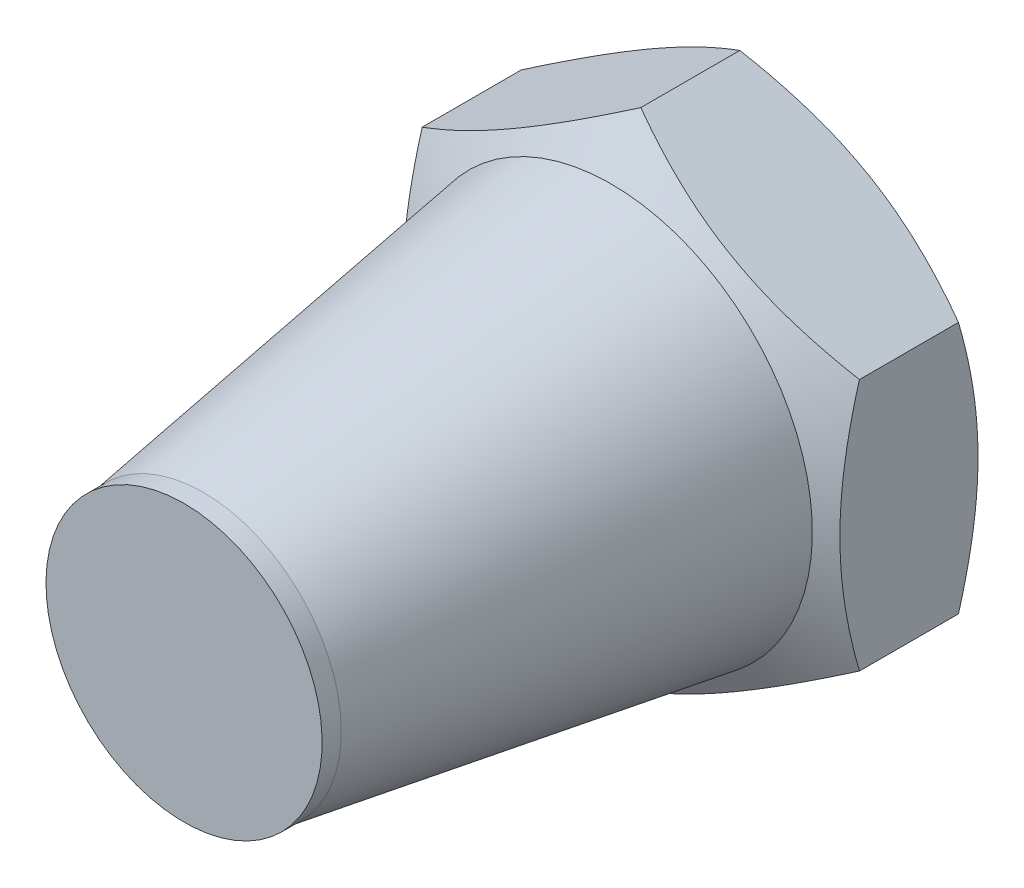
ISO-10303-21;
HEADER;
FILE_DESCRIPTION(('STEP AP214'),'2;1');
FILE_NAME('part.step','',(''),(''),'','','');
FILE_SCHEMA(('AUTOMOTIVE_DESIGN { 1 0 10303 214 1 1 1 1 }'));
ENDSEC;
DATA;
#1=APPLICATION_CONTEXT('core data for automotive mechanical design processes');
#2=APPLICATION_PROTOCOL_DEFINITION('international standard','automotive_design',2000,#1);
#3=PRODUCT_CONTEXT('',#1,'mechanical');
#4=PRODUCT('Part','Part','',(#3));
#5=PRODUCT_RELATED_PRODUCT_CATEGORY('part','',(#4));
#6=PRODUCT_DEFINITION_FORMATION('','',#4);
#7=PRODUCT_DEFINITION_CONTEXT('part definition',#1,'design');
#8=PRODUCT_DEFINITION('design','',#6,#7);
#9=PRODUCT_DEFINITION_SHAPE('','',#8);
#10=(LENGTH_UNIT() NAMED_UNIT(*) SI_UNIT(.MILLI.,.METRE.));
#11=(NAMED_UNIT(*) PLANE_ANGLE_UNIT() SI_UNIT($,.RADIAN.));
#12=(NAMED_UNIT(*) SI_UNIT($,.STERADIAN.) SOLID_ANGLE_UNIT());
#13=UNCERTAINTY_MEASURE_WITH_UNIT(LENGTH_MEASURE(1.E-05),#10,'distance_accuracy_value','');
#14=(GEOMETRIC_REPRESENTATION_CONTEXT(3) GLOBAL_UNCERTAINTY_ASSIGNED_CONTEXT((#13)) GLOBAL_UNIT_ASSIGNED_CONTEXT((#10,
#11,#12)) REPRESENTATION_CONTEXT('',''));
#15=CARTESIAN_POINT('',(0.,0.,0.));
#16=DIRECTION('',(0.,0.,1.));
#17=DIRECTION('',(1.,0.,0.));
#18=AXIS2_PLACEMENT_3D('',#15,#16,#17);
#19=CARTESIAN_POINT('',(0.,0.,3.));
#20=DIRECTION('',(0.,0.,-1.));
#21=DIRECTION('',(-0.500000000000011,0.866025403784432,0.));
#22=AXIS2_PLACEMENT_3D('',#19,#20,#21);
#23=CONICAL_SURFACE('',#22,14.696152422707,1.04719755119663);
#24=CARTESIAN_POINT('',(0.,0.,6.4387862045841));
#25=DIRECTION('',(0.,0.,-1.));
#26=DIRECTION('',(-0.500000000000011,0.866025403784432,0.));
#27=AXIS2_PLACEMENT_3D('',#24,#25,#26);
#28=CIRCLE('',#27,8.74);
#29=CARTESIAN_POINT('',(-4.3700000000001,7.56906202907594,6.4387862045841));
#30=VERTEX_POINT('',#29);
#31=EDGE_CURVE('E280',#30,#30,#28,.T.);
#32=ORIENTED_EDGE('',*,*,#31,.T.);
#33=EDGE_LOOP('',(#32));
#34=FACE_BOUND('',#33,.T.);
#35=CARTESIAN_POINT('',(-17.554595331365,0.83450477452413,1.33823181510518));
#36=CARTESIAN_POINT('',(-17.3747338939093,0.938347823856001,1.43910889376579));
#37=CARTESIAN_POINT('',(-17.1946626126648,1.04231202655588,1.53948688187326));
#38=CARTESIAN_POINT('',(-16.8340565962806,1.25050800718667,1.73913173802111));
#39=CARTESIAN_POINT('',(-16.653521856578,1.35473978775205,1.83839859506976));
#40=CARTESIAN_POINT('',(-16.1111093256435,1.66790180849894,2.13438889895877));
#41=CARTESIAN_POINT('',(-15.7484757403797,1.87726840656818,2.32927254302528));
#42=CARTESIAN_POINT('',(-15.0188452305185,2.29852077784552,2.71400300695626));
#43=CARTESIAN_POINT('',(-14.651835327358,2.5104140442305,2.90381708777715));
#44=CARTESIAN_POINT('',(-13.9149128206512,2.9358764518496,3.27574988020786));
#45=CARTESIAN_POINT('',(-13.5450003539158,3.14944551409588,3.45786895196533));
#46=CARTESIAN_POINT('',(-12.7895973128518,3.58557766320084,3.81814124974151));
#47=CARTESIAN_POINT('',(-12.4039911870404,3.80820746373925,3.99597319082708));
#48=CARTESIAN_POINT('',(-11.6282855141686,4.25606134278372,4.33830520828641));
#49=CARTESIAN_POINT('',(-11.238185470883,4.48128570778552,4.50280379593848));
#50=CARTESIAN_POINT('',(-10.4535819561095,4.93427675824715,4.81418869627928));
#51=CARTESIAN_POINT('',(-10.0590890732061,5.1620373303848,4.96111020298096));
#52=CARTESIAN_POINT('',(-9.26445874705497,5.62081736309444,5.23266326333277));
#53=CARTESIAN_POINT('',(-8.86432310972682,5.85183578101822,5.35730178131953));
#54=CARTESIAN_POINT('',(-8.06032905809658,6.31602196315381,5.57767285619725));
#55=CARTESIAN_POINT('',(-7.65650395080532,6.54917049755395,5.67356307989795));
#56=CARTESIAN_POINT('',(-7.04705287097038,6.90103724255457,5.79170894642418));
#57=CARTESIAN_POINT('',(-6.84326907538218,7.01869187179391,5.82681089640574));
#58=CARTESIAN_POINT('',(-6.4346731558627,7.25459483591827,5.8877644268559));
#59=CARTESIAN_POINT('',(-6.22986113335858,7.37284311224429,5.91361690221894));
#60=CARTESIAN_POINT('',(-5.82217958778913,7.60821816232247,5.9552293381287));
#61=CARTESIAN_POINT('',(-5.61931991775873,7.72533924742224,5.97111749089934));
#62=CARTESIAN_POINT('',(-5.21320037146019,7.95981247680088,5.99297114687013));
#63=CARTESIAN_POINT('',(-5.00994050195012,8.07716461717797,5.99893681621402));
#64=CARTESIAN_POINT('',(-4.60338385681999,8.31189020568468,6.00080302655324));
#65=CARTESIAN_POINT('',(-4.40008708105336,8.42926365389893,5.99670352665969));
#66=CARTESIAN_POINT('',(-3.99382512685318,8.66381910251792,5.97854027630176));
#67=CARTESIAN_POINT('',(-3.79085996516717,8.78100109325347,5.96447603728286));
#68=CARTESIAN_POINT('',(-3.3044770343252,9.06181440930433,5.91913176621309));
#69=CARTESIAN_POINT('',(-3.02137657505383,9.22526253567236,5.88321395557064));
#70=CARTESIAN_POINT('',(-2.45726005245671,9.55095536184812,5.79393895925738));
#71=CARTESIAN_POINT('',(-2.17624427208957,9.71319989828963,5.74057944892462));
#72=CARTESIAN_POINT('',(-1.33665683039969,10.1979359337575,5.55716611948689));
#73=CARTESIAN_POINT('',(-0.781851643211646,10.5182528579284,5.40380988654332));
#74=CARTESIAN_POINT('',(0.0478465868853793,10.997279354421,5.13760699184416));
#75=CARTESIAN_POINT('',(0.327036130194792,11.1584695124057,5.04158640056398));
#76=CARTESIAN_POINT('',(0.882703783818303,11.4792843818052,4.8395066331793));
#77=CARTESIAN_POINT('',(1.15918187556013,11.6389090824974,4.7334473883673));
#78=CARTESIAN_POINT('',(1.70951316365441,11.9566429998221,4.51299759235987));
#79=CARTESIAN_POINT('',(1.98336717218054,12.1147526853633,4.39860971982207));
#80=CARTESIAN_POINT('',(2.52880163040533,12.4296594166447,4.16285521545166));
#81=CARTESIAN_POINT('',(2.80038211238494,12.5864564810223,4.0414886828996));
#82=CARTESIAN_POINT('',(3.46345047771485,12.9692791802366,3.73693329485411));
#83=CARTESIAN_POINT('',(3.85382887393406,13.1946642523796,3.5505288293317));
#84=CARTESIAN_POINT('',(4.63109013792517,13.6434162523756,3.16821435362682));
#85=CARTESIAN_POINT('',(5.01797275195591,13.866783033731,2.9723036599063));
#86=CARTESIAN_POINT('',(5.78893210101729,14.3118966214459,2.57297026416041));
#87=CARTESIAN_POINT('',(6.17300807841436,14.5336429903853,2.36954561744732));
#88=CARTESIAN_POINT('',(6.93874708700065,14.9757426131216,1.95677322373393));
#89=CARTESIAN_POINT('',(7.32041017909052,15.1960959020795,1.74742562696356));
#90=CARTESIAN_POINT('',(8.08220788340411,15.635920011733,1.32370484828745));
#91=CARTESIAN_POINT('',(8.46234006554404,15.8553894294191,1.1093258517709));
#92=CARTESIAN_POINT('',(9.22094119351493,16.2933679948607,0.676679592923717));
#93=CARTESIAN_POINT('',(9.59941013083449,16.511877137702,0.4584123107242));
#94=CARTESIAN_POINT('',(10.354894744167,16.9480563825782,0.0187149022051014));
#95=CARTESIAN_POINT('',(10.7319106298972,17.1657266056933,-0.202714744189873));
#96=CARTESIAN_POINT('',(11.4847633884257,17.6003863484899,-0.648231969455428));
#97=CARTESIAN_POINT('',(11.8606002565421,17.8173758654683,-0.872319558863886));
#98=CARTESIAN_POINT('',(12.9195383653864,18.4287540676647,-1.50766534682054));
#99=CARTESIAN_POINT('',(13.6014831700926,18.8224750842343,-1.9214932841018));
#100=CARTESIAN_POINT('',(14.9628991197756,19.6084889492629,-2.7546043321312));
#101=CARTESIAN_POINT('',(15.6423701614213,20.0007817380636,-3.17388766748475));
#102=CARTESIAN_POINT('',(16.997542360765,20.783190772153,-4.01545975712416));
#103=CARTESIAN_POINT('',(17.6732487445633,21.1733100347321,-4.43773729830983));
#104=CARTESIAN_POINT('',(18.6856528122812,21.7578217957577,-5.07354826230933));
#105=CARTESIAN_POINT('',(19.0229182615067,21.9525420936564,-5.28587802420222));
#106=CARTESIAN_POINT('',(19.6971091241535,22.3417863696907,-5.7112548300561));
#107=CARTESIAN_POINT('',(20.0340345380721,22.5363103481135,-5.92430187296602));
#108=CARTESIAN_POINT('',(20.3708096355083,22.7307475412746,-6.13766535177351));
#109=B_SPLINE_CURVE_WITH_KNOTS('',3,(#35,#36,#37,#38,#39,#40,#41,#42,#43,#44,#45,#46,#47,#48,
#49,#50,#51,#52,#53,#54,#55,#56,#57,#58,#59,#60,#61,#62,#63,#64,#65,#66,#67,#68,#69,#70,#71,#72,
#73,#74,#75,#76,#77,#78,#79,#80,#81,#82,#83,#84,#85,#86,#87,#88,#89,#90,#91,#92,#93,#94,#95,#96,
#97,#98,#99,#100,#101,#102,#103,#104,#105,#106,#107,#108),.UNSPECIFIED.,.F.,.F.,(4,2,2,2,2,2,2,
2,2,2,2,2,2,2,2,2,2,2,2,2,2,2,2,2,2,2,2,2,2,2,2,2,2,2,2,2,4),(0.,0.692665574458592,
1.38533799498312,2.77088518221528,4.16388664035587,5.55682282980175,6.99503223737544,
8.4334020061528,9.86884178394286,11.3038321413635,12.7308020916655,13.4443879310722,
14.1579047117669,14.8620428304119,15.5661691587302,16.2702983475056,16.9744620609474,
17.9604967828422,18.9466629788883,20.9200570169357,21.9291006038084,22.9381510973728,
23.946878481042,24.9555915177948,26.4188141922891,27.8821422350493,29.3458516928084,
30.8095240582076,32.2749804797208,33.7404443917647,35.205688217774,36.6709378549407,
39.3395877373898,42.0083478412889,44.6698810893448,46.0005687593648,47.3312544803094),.UNSPECIFIED.);
#110=CARTESIAN_POINT('',(-1.81278603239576E-13,10.9696551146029,5.15149422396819));
#111=VERTEX_POINT('',#110);
#112=CARTESIAN_POINT('',(-9.5,5.48482755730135,5.15149422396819));
#113=VERTEX_POINT('',#112);
#114=EDGE_CURVE('E102',#111,#113,#109,.F.);
#115=ORIENTED_EDGE('',*,*,#114,.T.);
#116=CARTESIAN_POINT('',(-9.5,5.48505849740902,5.15142755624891));
#117=CARTESIAN_POINT('',(-9.5,5.24392149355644,5.22102656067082));
#118=CARTESIAN_POINT('',(-9.5,5.00188540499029,5.28746669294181));
#119=CARTESIAN_POINT('',(-9.5,4.51587227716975,5.41315271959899));
#120=CARTESIAN_POINT('',(-9.5,4.27189462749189,5.4723962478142));
#121=CARTESIAN_POINT('',(-9.5,3.53603045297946,5.63818542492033));
#122=CARTESIAN_POINT('',(-9.5,3.04123900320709,5.73248555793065));
#123=CARTESIAN_POINT('',(-9.5,2.30080624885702,5.84306129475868));
#124=CARTESIAN_POINT('',(-9.5,2.05737704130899,5.87456017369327));
#125=CARTESIAN_POINT('',(-9.5,1.56939156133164,5.92738179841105));
#126=CARTESIAN_POINT('',(-9.5,1.32483526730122,5.94870434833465));
#127=CARTESIAN_POINT('',(-9.5,0.83531474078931,5.98062697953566));
#128=CARTESIAN_POINT('',(-9.5,0.590351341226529,5.99123980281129));
#129=CARTESIAN_POINT('',(-9.5,0.100198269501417,6.00151746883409));
#130=CARTESIAN_POINT('',(-9.5,-0.14499139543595,6.00118264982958));
#131=CARTESIAN_POINT('',(-9.5,-0.603379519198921,5.99032663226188));
#132=CARTESIAN_POINT('',(-9.5,-0.816610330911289,5.98112973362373));
#133=CARTESIAN_POINT('',(-9.5,-1.24257325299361,5.95463460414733));
#134=CARTESIAN_POINT('',(-9.5,-1.45530532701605,5.9373358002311));
#135=CARTESIAN_POINT('',(-9.5,-2.09267726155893,5.87369551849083));
#136=CARTESIAN_POINT('',(-9.5,-2.51618892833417,5.81561809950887));
#137=CARTESIAN_POINT('',(-9.5,-3.36770470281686,5.67042398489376));
#138=CARTESIAN_POINT('',(-9.5,-3.79560013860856,5.58269183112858));
#139=CARTESIAN_POINT('',(-9.5,-4.64501006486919,5.38357626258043));
#140=CARTESIAN_POINT('',(-9.5,-5.06653543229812,5.27223961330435));
#141=CARTESIAN_POINT('',(-9.5,-5.4850584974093,5.15142755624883));
#142=B_SPLINE_CURVE_WITH_KNOTS('',3,(#116,#117,#118,#119,#120,#121,#122,#123,#124,#125,#126,
#127,#128,#129,#130,#131,#132,#133,#134,#135,#136,#137,#138,#139,#140,#141),.UNSPECIFIED.,.F.,
.F.,(4,2,2,2,2,2,2,2,2,2,2,2,4),(0.,0.752880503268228,1.50600787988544,3.01546870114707,
3.75167336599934,4.48789219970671,5.22323407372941,5.9585532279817,6.59868084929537,
7.23885375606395,8.52010929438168,9.82978009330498,11.1368800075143),.UNSPECIFIED.);
#143=CARTESIAN_POINT('',(-9.5,-5.48482755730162,5.15149422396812));
#144=VERTEX_POINT('',#143);
#145=EDGE_CURVE('E93',#113,#144,#142,.T.);
#146=ORIENTED_EDGE('',*,*,#145,.T.);
#147=CARTESIAN_POINT('',(-9.5002,-5.48471208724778,5.15142755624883));
#148=CARTESIAN_POINT('',(-9.2913692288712,-5.60528058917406,5.22102656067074));
#149=CARTESIAN_POINT('',(-9.08175982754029,-5.72629863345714,5.28746669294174));
#150=CARTESIAN_POINT('',(-8.66086011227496,-5.9693051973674,5.41315271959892));
#151=CARTESIAN_POINT('',(-8.4495692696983,-6.09129402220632,5.47239624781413));
#152=CARTESIAN_POINT('',(-7.81229220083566,-6.45922610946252,5.63818542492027));
#153=CARTESIAN_POINT('',(-7.38379023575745,-6.7066218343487,5.7324855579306));
#154=CARTESIAN_POINT('',(-6.74255666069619,-7.07683821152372,5.84306129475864));
#155=CARTESIAN_POINT('',(-6.53174078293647,-7.19855281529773,5.87456017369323));
#156=CARTESIAN_POINT('',(-6.10913296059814,-7.4425455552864,5.92738179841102));
#157=CARTESIAN_POINT('',(-5.89734099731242,-7.5648237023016,5.94870434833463));
#158=CARTESIAN_POINT('',(-5.47340378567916,-7.80958396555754,5.98062697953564));
#159=CARTESIAN_POINT('',(-5.26125925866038,-7.93206566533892,5.99123980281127));
#160=CARTESIAN_POINT('',(-4.83677424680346,-8.17714220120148,6.00151746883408));
#161=CARTESIAN_POINT('',(-4.62443376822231,-8.29973703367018,6.00118264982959));
#162=CARTESIAN_POINT('',(-4.22745800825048,-8.52893109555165,5.99032663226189));
#163=CARTESIAN_POINT('',(-4.04279470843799,-8.63554650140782,5.98112973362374));
#164=CARTESIAN_POINT('',(-3.67389999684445,-8.84852796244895,5.95463460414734));
#165=CARTESIAN_POINT('',(-3.48966861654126,-8.95489399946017,5.93733580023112));
#166=CARTESIAN_POINT('',(-2.93768832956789,-9.2735799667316,5.87369551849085));
#167=CARTESIAN_POINT('',(-2.57091646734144,-9.4853358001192,5.81561809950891));
#168=CARTESIAN_POINT('',(-1.83348217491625,-9.91109368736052,5.67042398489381));
#169=CARTESIAN_POINT('',(-1.46291385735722,-10.1250414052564,5.58269183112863));
#170=CARTESIAN_POINT('',(-0.72730328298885,-10.5497463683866,5.38357626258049));
#171=CARTESIAN_POINT('',(-0.362251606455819,-10.7605090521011,5.27223961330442));
#172=CARTESIAN_POINT('',(0.000200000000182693,-10.9697705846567,5.15142755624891));
#173=B_SPLINE_CURVE_WITH_KNOTS('',3,(#147,#148,#149,#150,#151,#152,#153,#154,#155,#156,#157,
#158,#159,#160,#161,#162,#163,#164,#165,#166,#167,#168,#169,#170,#171,#172),.UNSPECIFIED.,.F.,
.F.,(4,2,2,2,2,2,2,2,2,2,2,2,4),(0.,0.752880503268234,1.50600787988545,3.01546870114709,
3.75167336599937,4.48789219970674,5.22323407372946,5.95855322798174,6.59868084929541,
7.23885375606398,8.5201092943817,9.82978009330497,11.1368800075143),.UNSPECIFIED.);
#174=CARTESIAN_POINT('',(1.81278603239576E-13,-10.9696551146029,5.15149422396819));
#175=VERTEX_POINT('',#174);
#176=EDGE_CURVE('E82',#144,#175,#173,.T.);
#177=ORIENTED_EDGE('',*,*,#176,.T.);
#178=CARTESIAN_POINT('',(-8.0545953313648,-15.6199778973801,1.33823181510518));
#179=CARTESIAN_POINT('',(-7.87473389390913,-15.5161348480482,1.43910889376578));
#180=CARTESIAN_POINT('',(-7.69466261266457,-15.4121706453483,1.53948688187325));
#181=CARTESIAN_POINT('',(-7.33405659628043,-15.2039746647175,1.7391317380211));
#182=CARTESIAN_POINT('',(-7.15352185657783,-15.0997428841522,1.83839859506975));
#183=CARTESIAN_POINT('',(-6.61110932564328,-14.7865808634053,2.13438889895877));
#184=CARTESIAN_POINT('',(-6.24847574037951,-14.577214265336,2.32927254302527));
#185=CARTESIAN_POINT('',(-5.51884523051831,-14.1559618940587,2.71400300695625));
#186=CARTESIAN_POINT('',(-5.15183532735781,-13.9440686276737,2.90381708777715));
#187=CARTESIAN_POINT('',(-4.41491282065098,-13.5186062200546,3.27574988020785));
#188=CARTESIAN_POINT('',(-4.04500035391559,-13.3050371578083,3.45786895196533));
#189=CARTESIAN_POINT('',(-3.28959731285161,-12.8689050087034,3.81814124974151));
#190=CARTESIAN_POINT('',(-2.90399118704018,-12.646275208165,3.99597319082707));
#191=CARTESIAN_POINT('',(-2.12828551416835,-12.1984213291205,4.33830520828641));
#192=CARTESIAN_POINT('',(-1.73818547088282,-11.9731969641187,4.50280379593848));
#193=CARTESIAN_POINT('',(-0.953581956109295,-11.5202059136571,4.81418869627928));
#194=CARTESIAN_POINT('',(-0.559089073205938,-11.2924453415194,4.96111020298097));
#195=CARTESIAN_POINT('',(0.23554125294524,-10.8336653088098,5.23266326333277));
#196=CARTESIAN_POINT('',(0.635676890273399,-10.602646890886,5.35730178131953));
#197=CARTESIAN_POINT('',(1.43967094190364,-10.1384607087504,5.57767285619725));
#198=CARTESIAN_POINT('',(1.84349604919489,-9.90531217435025,5.67356307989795));
#199=CARTESIAN_POINT('',(2.45294712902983,-9.55344542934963,5.79170894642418));
#200=CARTESIAN_POINT('',(2.65673092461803,-9.4357908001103,5.82681089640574));
#201=CARTESIAN_POINT('',(3.06532684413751,-9.19988783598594,5.8877644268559));
#202=CARTESIAN_POINT('',(3.27013886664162,-9.08163955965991,5.91361690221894));
#203=CARTESIAN_POINT('',(3.67782041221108,-8.84626450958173,5.9552293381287));
#204=CARTESIAN_POINT('',(3.88068008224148,-8.72914342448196,5.97111749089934));
#205=CARTESIAN_POINT('',(4.28679962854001,-8.49467019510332,5.99297114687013));
#206=CARTESIAN_POINT('',(4.49005949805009,-8.37731805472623,5.99893681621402));
#207=CARTESIAN_POINT('',(4.89661614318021,-8.14259246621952,6.00080302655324));
#208=CARTESIAN_POINT('',(5.09991291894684,-8.02521901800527,5.99670352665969));
#209=CARTESIAN_POINT('',(5.50617487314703,-7.79066356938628,5.97854027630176));
#210=CARTESIAN_POINT('',(5.70914003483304,-7.67348157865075,5.96447603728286));
#211=CARTESIAN_POINT('',(6.19552296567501,-7.39266826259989,5.91913176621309));
#212=CARTESIAN_POINT('',(6.47862342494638,-7.22922013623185,5.88321395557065));
#213=CARTESIAN_POINT('',(7.0427399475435,-6.90352731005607,5.79393895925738));
#214=CARTESIAN_POINT('',(7.32375572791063,-6.74128277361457,5.74057944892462));
#215=CARTESIAN_POINT('',(8.16334316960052,-6.25654673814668,5.55716611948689));
#216=CARTESIAN_POINT('',(8.71814835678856,-5.93622981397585,5.40380988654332));
#217=CARTESIAN_POINT('',(9.54784658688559,-5.45720331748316,5.13760699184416));
#218=CARTESIAN_POINT('',(9.827036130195,-5.29601315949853,5.04158640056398));
#219=CARTESIAN_POINT('',(10.3827037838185,-4.97519829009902,4.8395066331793));
#220=CARTESIAN_POINT('',(10.6591818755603,-4.81557358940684,4.7334473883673));
#221=CARTESIAN_POINT('',(11.2095131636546,-4.49783967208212,4.51299759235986));
#222=CARTESIAN_POINT('',(11.4833671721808,-4.3397299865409,4.39860971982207));
#223=CARTESIAN_POINT('',(12.0288016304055,-4.02482325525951,4.16285521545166));
#224=CARTESIAN_POINT('',(12.3003821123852,-3.86802619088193,4.0414886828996));
#225=CARTESIAN_POINT('',(12.9634504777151,-3.48520349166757,3.73693329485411));
#226=CARTESIAN_POINT('',(13.3538288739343,-3.25981841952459,3.5505288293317));
#227=CARTESIAN_POINT('',(14.1310901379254,-2.81106641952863,3.16821435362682));
#228=CARTESIAN_POINT('',(14.5179727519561,-2.58769963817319,2.97230365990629));
#229=CARTESIAN_POINT('',(15.2889321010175,-2.14258605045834,2.57297026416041));
#230=CARTESIAN_POINT('',(15.6730080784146,-1.92083968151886,2.36954561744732));
#231=CARTESIAN_POINT('',(16.4387470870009,-1.47874005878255,1.95677322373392));
#232=CARTESIAN_POINT('',(16.8204101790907,-1.25838676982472,1.74742562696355));
#233=CARTESIAN_POINT('',(17.5822078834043,-0.818562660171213,1.32370484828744));
#234=CARTESIAN_POINT('',(17.9623400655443,-0.599093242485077,1.1093258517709));
#235=CARTESIAN_POINT('',(18.7209411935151,-0.161114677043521,0.676679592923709));
#236=CARTESIAN_POINT('',(19.0994101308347,0.0573944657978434,0.458412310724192));
#237=CARTESIAN_POINT('',(19.8548947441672,0.493573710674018,0.0187149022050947));
#238=CARTESIAN_POINT('',(20.2319106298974,0.711243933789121,-0.202714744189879));
#239=CARTESIAN_POINT('',(20.9847633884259,1.14590367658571,-0.648231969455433));
#240=CARTESIAN_POINT('',(21.3606002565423,1.3628931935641,-0.872319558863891));
#241=CARTESIAN_POINT('',(22.4195383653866,1.97427139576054,-1.50766534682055));
#242=CARTESIAN_POINT('',(23.1014831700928,2.3679924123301,-1.9214932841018));
#243=CARTESIAN_POINT('',(24.4628991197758,3.15400627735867,-2.7546043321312));
#244=CARTESIAN_POINT('',(25.1423701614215,3.54629906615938,-3.17388766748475));
#245=CARTESIAN_POINT('',(26.4975423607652,4.3287081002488,-4.01545975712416));
#246=CARTESIAN_POINT('',(27.1732487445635,4.7188273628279,-4.43773729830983));
#247=CARTESIAN_POINT('',(28.1856528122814,5.30333912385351,-5.07354826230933));
#248=CARTESIAN_POINT('',(28.5229182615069,5.49805942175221,-5.28587802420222));
#249=CARTESIAN_POINT('',(29.1971091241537,5.88730369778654,-5.71125483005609));
#250=CARTESIAN_POINT('',(29.5340345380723,6.08182767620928,-5.92430187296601));
#251=CARTESIAN_POINT('',(29.8708096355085,6.27626486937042,-6.13766535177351));
#252=B_SPLINE_CURVE_WITH_KNOTS('',3,(#178,#179,#180,#181,#182,#183,#184,#185,#186,#187,#188,
#189,#190,#191,#192,#193,#194,#195,#196,#197,#198,#199,#200,#201,#202,#203,#204,#205,#206,#207,
#208,#209,#210,#211,#212,#213,#214,#215,#216,#217,#218,#219,#220,#221,#222,#223,#224,#225,#226,
#227,#228,#229,#230,#231,#232,#233,#234,#235,#236,#237,#238,#239,#240,#241,#242,#243,#244,#245,
#246,#247,#248,#249,#250,#251),.UNSPECIFIED.,.F.,.F.,(4,2,2,2,2,2,2,2,2,2,2,2,2,2,2,2,2,2,2,2,2,
2,2,2,2,2,2,2,2,2,2,2,2,2,2,2,4),(0.,0.692665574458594,1.38533799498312,2.77088518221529,
4.16388664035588,5.55682282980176,6.99503223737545,8.43340200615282,9.86884178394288,
11.3038321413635,12.7308020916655,13.4443879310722,14.1579047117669,14.8620428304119,
15.5661691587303,16.2702983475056,16.9744620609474,17.9604967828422,18.9466629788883,
20.9200570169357,21.9291006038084,22.9381510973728,23.946878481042,24.9555915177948,
26.4188141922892,27.8821422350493,29.3458516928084,30.8095240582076,32.2749804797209,
33.7404443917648,35.205688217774,36.6709378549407,39.3395877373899,42.0083478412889,
44.6698810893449,46.0005687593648,47.3312544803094),.UNSPECIFIED.);
#253=CARTESIAN_POINT('',(9.5,-5.48482755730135,5.15149422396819));
#254=VERTEX_POINT('',#253);
#255=EDGE_CURVE('E229',#175,#254,#252,.T.);
#256=ORIENTED_EDGE('',*,*,#255,.T.);
#257=CARTESIAN_POINT('',(9.5,-5.48505849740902,5.15142755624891));
#258=CARTESIAN_POINT('',(9.5,-5.24392149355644,5.22102656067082));
#259=CARTESIAN_POINT('',(9.5,-5.00188540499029,5.28746669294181));
#260=CARTESIAN_POINT('',(9.5,-4.51587227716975,5.41315271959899));
#261=CARTESIAN_POINT('',(9.5,-4.27189462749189,5.4723962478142));
#262=CARTESIAN_POINT('',(9.5,-3.53603045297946,5.63818542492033));
#263=CARTESIAN_POINT('',(9.5,-3.04123900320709,5.73248555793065));
#264=CARTESIAN_POINT('',(9.5,-2.30080624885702,5.84306129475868));
#265=CARTESIAN_POINT('',(9.5,-2.05737704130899,5.87456017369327));
#266=CARTESIAN_POINT('',(9.5,-1.56939156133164,5.92738179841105));
#267=CARTESIAN_POINT('',(9.5,-1.32483526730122,5.94870434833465));
#268=CARTESIAN_POINT('',(9.5,-0.83531474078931,5.98062697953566));
#269=CARTESIAN_POINT('',(9.5,-0.590351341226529,5.99123980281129));
#270=CARTESIAN_POINT('',(9.5,-0.100198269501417,6.00151746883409));
#271=CARTESIAN_POINT('',(9.5,0.14499139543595,6.00118264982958));
#272=CARTESIAN_POINT('',(9.5,0.603379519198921,5.99032663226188));
#273=CARTESIAN_POINT('',(9.5,0.816610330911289,5.98112973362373));
#274=CARTESIAN_POINT('',(9.5,1.24257325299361,5.95463460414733));
#275=CARTESIAN_POINT('',(9.5,1.45530532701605,5.9373358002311));
#276=CARTESIAN_POINT('',(9.5,2.09267726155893,5.87369551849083));
#277=CARTESIAN_POINT('',(9.5,2.51618892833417,5.81561809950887));
#278=CARTESIAN_POINT('',(9.5,3.36770470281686,5.67042398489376));
#279=CARTESIAN_POINT('',(9.5,3.79560013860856,5.58269183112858));
#280=CARTESIAN_POINT('',(9.5,4.64501006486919,5.38357626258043));
#281=CARTESIAN_POINT('',(9.5,5.06653543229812,5.27223961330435));
#282=CARTESIAN_POINT('',(9.5,5.4850584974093,5.15142755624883));
#283=B_SPLINE_CURVE_WITH_KNOTS('',3,(#257,#258,#259,#260,#261,#262,#263,#264,#265,#266,#267,
#268,#269,#270,#271,#272,#273,#274,#275,#276,#277,#278,#279,#280,#281,#282),.UNSPECIFIED.,.F.,
.F.,(4,2,2,2,2,2,2,2,2,2,2,2,4),(0.,0.752880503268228,1.50600787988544,3.01546870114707,
3.75167336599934,4.48789219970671,5.22323407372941,5.9585532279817,6.59868084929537,
7.23885375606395,8.52010929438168,9.82978009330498,11.1368800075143),.UNSPECIFIED.);
#284=CARTESIAN_POINT('',(9.5,5.48482755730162,5.15149422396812));
#285=VERTEX_POINT('',#284);
#286=EDGE_CURVE('E215',#254,#285,#283,.T.);
#287=ORIENTED_EDGE('',*,*,#286,.T.);
#288=CARTESIAN_POINT('',(9.5002,5.48471208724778,5.15142755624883));
#289=CARTESIAN_POINT('',(9.2913692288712,5.60528058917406,5.22102656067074));
#290=CARTESIAN_POINT('',(9.08175982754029,5.72629863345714,5.28746669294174));
#291=CARTESIAN_POINT('',(8.66086011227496,5.9693051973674,5.41315271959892));
#292=CARTESIAN_POINT('',(8.4495692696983,6.09129402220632,5.47239624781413));
#293=CARTESIAN_POINT('',(7.81229220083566,6.45922610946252,5.63818542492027));
#294=CARTESIAN_POINT('',(7.38379023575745,6.7066218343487,5.7324855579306));
#295=CARTESIAN_POINT('',(6.74255666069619,7.07683821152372,5.84306129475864));
#296=CARTESIAN_POINT('',(6.53174078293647,7.19855281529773,5.87456017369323));
#297=CARTESIAN_POINT('',(6.10913296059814,7.4425455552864,5.92738179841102));
#298=CARTESIAN_POINT('',(5.89734099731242,7.5648237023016,5.94870434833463));
#299=CARTESIAN_POINT('',(5.47340378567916,7.80958396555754,5.98062697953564));
#300=CARTESIAN_POINT('',(5.26125925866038,7.93206566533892,5.99123980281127));
#301=CARTESIAN_POINT('',(4.83677424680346,8.17714220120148,6.00151746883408));
#302=CARTESIAN_POINT('',(4.62443376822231,8.29973703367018,6.00118264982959));
#303=CARTESIAN_POINT('',(4.22745800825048,8.52893109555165,5.99032663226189));
#304=CARTESIAN_POINT('',(4.04279470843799,8.63554650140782,5.98112973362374));
#305=CARTESIAN_POINT('',(3.67389999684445,8.84852796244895,5.95463460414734));
#306=CARTESIAN_POINT('',(3.48966861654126,8.95489399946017,5.93733580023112));
#307=CARTESIAN_POINT('',(2.93768832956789,9.2735799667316,5.87369551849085));
#308=CARTESIAN_POINT('',(2.57091646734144,9.4853358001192,5.81561809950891));
#309=CARTESIAN_POINT('',(1.83348217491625,9.91109368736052,5.67042398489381));
#310=CARTESIAN_POINT('',(1.46291385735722,10.1250414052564,5.58269183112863));
#311=CARTESIAN_POINT('',(0.72730328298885,10.5497463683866,5.38357626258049));
#312=CARTESIAN_POINT('',(0.362251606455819,10.7605090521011,5.27223961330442));
#313=CARTESIAN_POINT('',(-0.000200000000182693,10.9697705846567,5.15142755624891));
#314=B_SPLINE_CURVE_WITH_KNOTS('',3,(#288,#289,#290,#291,#292,#293,#294,#295,#296,#297,#298,
#299,#300,#301,#302,#303,#304,#305,#306,#307,#308,#309,#310,#311,#312,#313),.UNSPECIFIED.,.F.,
.F.,(4,2,2,2,2,2,2,2,2,2,2,2,4),(0.,0.752880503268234,1.50600787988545,3.01546870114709,
3.75167336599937,4.48789219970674,5.22323407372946,5.95855322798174,6.59868084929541,
7.23885375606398,8.5201092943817,9.82978009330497,11.1368800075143),.UNSPECIFIED.);
#315=EDGE_CURVE('E188',#285,#111,#314,.T.);
#316=ORIENTED_EDGE('',*,*,#315,.T.);
#317=EDGE_LOOP('',(#115,#146,#177,#256,#287,#316));
#318=FACE_BOUND('',#317,.T.);
#319=ADVANCED_FACE('F14',(#34,#318),#23,.T.);
#320=CARTESIAN_POINT('',(0.,0.,25.));
#321=DIRECTION('',(0.,0.,1.));
#322=DIRECTION('',(0.500000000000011,-0.866025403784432,0.));
#323=AXIS2_PLACEMENT_3D('',#320,#321,#322);
#324=PLANE('',#323);
#325=CARTESIAN_POINT('',(0.,0.,25.));
#326=DIRECTION('',(0.,0.,-1.));
#327=DIRECTION('',(-0.500000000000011,0.866025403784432,0.));
#328=AXIS2_PLACEMENT_3D('',#325,#326,#327);
#329=CIRCLE('',#328,6.);
#330=CARTESIAN_POINT('',(-3.00000000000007,5.19615242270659,25.));
#331=VERTEX_POINT('',#330);
#332=EDGE_CURVE('E9',#331,#331,#329,.T.);
#333=ORIENTED_EDGE('',*,*,#332,.F.);
#334=EDGE_LOOP('',(#333));
#335=FACE_BOUND('',#334,.T.);
#336=ADVANCED_FACE('F16',(#335),#324,.T.);
#337=CARTESIAN_POINT('',(0.,0.,19.903));
#338=DIRECTION('',(0.,0.,-1.));
#339=DIRECTION('',(-0.500000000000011,0.866025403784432,0.));
#340=AXIS2_PLACEMENT_3D('',#337,#338,#339);
#341=CYLINDRICAL_SURFACE('',#340,6.);
#342=ORIENTED_EDGE('',*,*,#332,.T.);
#343=EDGE_LOOP('',(#342));
#344=FACE_BOUND('',#343,.T.);
#345=CARTESIAN_POINT('',(0.,0.,24.166666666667));
#346=DIRECTION('',(0.,0.,-1.));
#347=DIRECTION('',(-0.500000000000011,0.866025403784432,0.));
#348=AXIS2_PLACEMENT_3D('',#345,#346,#347);
#349=CIRCLE('',#348,6.);
#350=CARTESIAN_POINT('',(-3.00000000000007,5.19615242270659,24.166666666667));
#351=VERTEX_POINT('',#350);
#352=EDGE_CURVE('E22',#351,#351,#349,.T.);
#353=ORIENTED_EDGE('',*,*,#352,.F.);
#354=EDGE_LOOP('',(#353));
#355=FACE_BOUND('',#354,.T.);
#356=ADVANCED_FACE('F301',(#344,#355),#341,.T.);
#357=CARTESIAN_POINT('',(0.,0.,6.4387862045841));
#358=DIRECTION('',(0.,0.,-1.));
#359=DIRECTION('',(-0.500000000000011,0.866025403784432,0.));
#360=AXIS2_PLACEMENT_3D('',#357,#358,#359);
#361=CONICAL_SURFACE('',#360,8.74,0.153345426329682);
#362=ORIENTED_EDGE('',*,*,#352,.T.);
#363=EDGE_LOOP('',(#362));
#364=FACE_BOUND('',#363,.T.);
#365=ORIENTED_EDGE('',*,*,#31,.F.);
#366=EDGE_LOOP('',(#365));
#367=FACE_BOUND('',#366,.T.);
#368=ADVANCED_FACE('F131',(#364,#367),#361,.T.);
#369=CARTESIAN_POINT('',(-9.5,5.48482755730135,-25.));
#370=DIRECTION('',(-1.,0.,0.));
#371=DIRECTION('',(0.,-1.,0.));
#372=AXIS2_PLACEMENT_3D('',#369,#370,#371);
#373=PLANE('',#372);
#374=DIRECTION('',(0.,0.,1.));
#375=VECTOR('',#374,1.);
#376=CARTESIAN_POINT('',(-9.5,5.48482755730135,-25.));
#377=LINE('',#376,#375);
#378=CARTESIAN_POINT('',(-9.5,5.48482755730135,0.848505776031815));
#379=VERTEX_POINT('',#378);
#380=EDGE_CURVE('E258',#379,#113,#377,.T.);
#381=ORIENTED_EDGE('',*,*,#380,.F.);
#382=CARTESIAN_POINT('',(-9.5,-5.4850584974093,0.848572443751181));
#383=CARTESIAN_POINT('',(-9.5,-5.24392149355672,0.778973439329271));
#384=CARTESIAN_POINT('',(-9.5,-5.00188540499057,0.712533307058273));
#385=CARTESIAN_POINT('',(-9.5,-4.51587227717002,0.586847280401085));
#386=CARTESIAN_POINT('',(-9.5,-4.27189462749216,0.527603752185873));
#387=CARTESIAN_POINT('',(-9.5,-3.53603045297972,0.361814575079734));
#388=CARTESIAN_POINT('',(-9.5,-3.04123900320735,0.267514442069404));
#389=CARTESIAN_POINT('',(-9.5,-2.30080624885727,0.156938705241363));
#390=CARTESIAN_POINT('',(-9.5,-2.05737704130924,0.125439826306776));
#391=CARTESIAN_POINT('',(-9.5,-1.56939156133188,0.0726182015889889));
#392=CARTESIAN_POINT('',(-9.5,-1.32483526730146,0.0512956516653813));
#393=CARTESIAN_POINT('',(-9.5,-0.835314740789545,0.0193730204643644));
#394=CARTESIAN_POINT('',(-9.5,-0.590351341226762,0.00876019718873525));
#395=CARTESIAN_POINT('',(-9.5,-0.100198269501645,-0.00151746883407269));
#396=CARTESIAN_POINT('',(-9.5,0.144991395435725,-0.0011826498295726));
#397=CARTESIAN_POINT('',(-9.5,0.603379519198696,0.0096733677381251));
#398=CARTESIAN_POINT('',(-9.5,0.816610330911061,0.018870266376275));
#399=CARTESIAN_POINT('',(-9.5,1.24257325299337,0.0453653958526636));
#400=CARTESIAN_POINT('',(-9.5,1.45530532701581,0.0626641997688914));
#401=CARTESIAN_POINT('',(-9.5,2.09267726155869,0.126304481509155));
#402=CARTESIAN_POINT('',(-9.5,2.51618892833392,0.184381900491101));
#403=CARTESIAN_POINT('',(-9.5,3.3677047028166,0.3295760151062));
#404=CARTESIAN_POINT('',(-9.5,3.7956001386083,0.417308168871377));
#405=CARTESIAN_POINT('',(-9.5,4.64501006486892,0.616423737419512));
#406=CARTESIAN_POINT('',(-9.5,5.06653543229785,0.727760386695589));
#407=CARTESIAN_POINT('',(-9.5,5.48505849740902,0.848572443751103));
#408=B_SPLINE_CURVE_WITH_KNOTS('',3,(#382,#383,#384,#385,#386,#387,#388,#389,#390,#391,#392,
#393,#394,#395,#396,#397,#398,#399,#400,#401,#402,#403,#404,#405,#406,#407),.UNSPECIFIED.,.F.,
.F.,(4,2,2,2,2,2,2,2,2,2,2,2,4),(0.,0.752880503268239,1.50600787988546,3.0154687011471,
3.75167336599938,4.48789219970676,5.22323407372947,5.95855322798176,6.59868084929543,
7.238853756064,8.52010929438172,9.829780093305,11.1368800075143),.UNSPECIFIED.);
#409=CARTESIAN_POINT('',(-9.5,0.,0.));
#410=VERTEX_POINT('',#409);
#411=EDGE_CURVE('E109',#410,#379,#408,.T.);
#412=ORIENTED_EDGE('',*,*,#411,.F.);
#413=CARTESIAN_POINT('',(-9.5,-5.48482755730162,0.848505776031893));
#414=VERTEX_POINT('',#413);
#415=EDGE_CURVE('E96',#414,#410,#408,.T.);
#416=ORIENTED_EDGE('',*,*,#415,.F.);
#417=DIRECTION('',(0.,0.,1.));
#418=VECTOR('',#417,1.);
#419=CARTESIAN_POINT('',(-9.5,-5.48482755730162,-25.));
#420=LINE('',#419,#418);
#421=EDGE_CURVE('E35',#414,#144,#420,.T.);
#422=ORIENTED_EDGE('',*,*,#421,.T.);
#423=ORIENTED_EDGE('',*,*,#145,.F.);
#424=EDGE_LOOP('',(#381,#412,#416,#422,#423));
#425=FACE_BOUND('',#424,.T.);
#426=ADVANCED_FACE('F92',(#425),#373,.T.);
#427=CARTESIAN_POINT('',(-1.81278603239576E-13,10.9696551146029,-25.));
#428=DIRECTION('',(-0.500000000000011,0.866025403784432,0.));
#429=DIRECTION('',(-0.866025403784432,-0.500000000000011,0.));
#430=AXIS2_PLACEMENT_3D('',#427,#428,#429);
#431=PLANE('',#430);
#432=DIRECTION('',(0.,0.,1.));
#433=VECTOR('',#432,1.);
#434=CARTESIAN_POINT('',(-1.81278603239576E-13,10.9696551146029,-25.));
#435=LINE('',#434,#433);
#436=CARTESIAN_POINT('',(-1.81278603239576E-13,10.9696551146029,0.848505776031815));
#437=VERTEX_POINT('',#436);
#438=EDGE_CURVE('E255',#437,#111,#435,.T.);
#439=ORIENTED_EDGE('',*,*,#438,.F.);
#440=CARTESIAN_POINT('',(-17.6079762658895,0.803685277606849,4.69172618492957));
#441=CARTESIAN_POINT('',(-17.4278975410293,0.907653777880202,4.59060472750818));
#442=CARTESIAN_POINT('',(-17.2476101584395,1.01174274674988,4.48997893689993));
#443=CARTESIAN_POINT('',(-16.8865745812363,1.22018673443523,4.28983072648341));
#444=CARTESIAN_POINT('',(-16.7058263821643,1.32454175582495,4.19030831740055));
#445=CARTESIAN_POINT('',(-16.1627785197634,1.63807058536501,3.89353871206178));
#446=CARTESIAN_POINT('',(-15.799727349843,1.84767827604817,3.69811828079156));
#447=CARTESIAN_POINT('',(-15.0692994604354,2.26939101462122,3.3122810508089));
#448=CARTESIAN_POINT('',(-14.7019100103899,2.48150341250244,3.12189630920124));
#449=CARTESIAN_POINT('',(-13.9642441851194,2.90739497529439,2.74876351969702));
#450=CARTESIAN_POINT('',(-13.5939679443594,3.12117406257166,2.56601511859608));
#451=CARTESIAN_POINT('',(-12.8375931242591,3.55786726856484,2.20426740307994));
#452=CARTESIAN_POINT('',(-12.4513771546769,3.78084916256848,2.02559358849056));
#453=CARTESIAN_POINT('',(-11.674464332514,4.22939998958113,1.68149388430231));
#454=CARTESIAN_POINT('',(-11.2837669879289,4.45496920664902,1.5160694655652));
#455=CARTESIAN_POINT('',(-10.4979649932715,4.90865219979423,1.20272862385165));
#456=CARTESIAN_POINT('',(-10.1028707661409,5.13675995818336,1.05477771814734));
#457=CARTESIAN_POINT('',(-9.30702925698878,5.59623926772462,0.781054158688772));
#458=CARTESIAN_POINT('',(-8.90628376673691,5.82760978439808,0.655274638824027));
#459=CARTESIAN_POINT('',(-8.10110070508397,6.29248244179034,0.43254028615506));
#460=CARTESIAN_POINT('',(-7.69669749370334,6.52596474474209,0.335424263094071));
#461=CARTESIAN_POINT('',(-7.08633198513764,6.87835943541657,0.215390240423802));
#462=CARTESIAN_POINT('',(-6.88223572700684,6.99619446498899,0.179650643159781));
#463=CARTESIAN_POINT('',(-6.4729954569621,7.23246944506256,0.11741628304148));
#464=CARTESIAN_POINT('',(-6.26785154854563,7.35090933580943,0.0909206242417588));
#465=CARTESIAN_POINT('',(-5.85951371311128,7.58666329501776,0.048040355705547));
#466=CARTESIAN_POINT('',(-5.65633002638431,7.70397145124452,0.0315262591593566));
#467=CARTESIAN_POINT('',(-5.24953960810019,7.93883200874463,0.00844006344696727));
#468=CARTESIAN_POINT('',(-5.04593288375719,8.05638440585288,0.00186779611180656));
#469=CARTESIAN_POINT('',(-4.6386613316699,8.29152274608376,-0.00117752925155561));
#470=CARTESIAN_POINT('',(-4.43499650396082,8.40910868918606,0.00234940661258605));
#471=CARTESIAN_POINT('',(-4.02797922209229,8.64410022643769,0.0194147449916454));
#472=CARTESIAN_POINT('',(-3.82462678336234,8.76150581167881,0.0329536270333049));
#473=CARTESIAN_POINT('',(-3.33886786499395,9.04195885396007,0.0769634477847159));
#474=CARTESIAN_POINT('',(-3.05676444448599,9.20483133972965,0.111994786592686));
#475=CARTESIAN_POINT('',(-2.49460019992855,9.52939701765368,0.199439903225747));
#476=CARTESIAN_POINT('',(-2.21453964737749,9.69109005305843,0.25185594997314));
#477=CARTESIAN_POINT('',(-1.37777018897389,10.1741991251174,0.432406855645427));
#478=CARTESIAN_POINT('',(-0.824774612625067,10.4934712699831,0.583813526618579));
#479=CARTESIAN_POINT('',(0.00221202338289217,10.9709322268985,0.84712031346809));
#480=CARTESIAN_POINT('',(0.280475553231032,11.131587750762,0.942164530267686));
#481=CARTESIAN_POINT('',(0.834301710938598,11.4513394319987,1.1423154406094));
#482=CARTESIAN_POINT('',(1.10986432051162,11.6104355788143,1.24742220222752));
#483=CARTESIAN_POINT('',(1.65837183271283,11.9271165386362,1.46599605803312));
#484=CARTESIAN_POINT('',(1.93131752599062,12.0847018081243,1.57946053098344));
#485=CARTESIAN_POINT('',(2.47493670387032,12.3985604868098,1.81339584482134));
#486=CARTESIAN_POINT('',(2.74561021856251,12.5548339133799,1.93386659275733));
#487=CARTESIAN_POINT('',(3.39739076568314,12.9311395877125,2.23211274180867));
#488=CARTESIAN_POINT('',(3.7774841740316,13.1505866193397,2.41283667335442));
#489=CARTESIAN_POINT('',(4.53431346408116,13.5875422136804,2.78345507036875));
#490=CARTESIAN_POINT('',(4.91104911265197,13.8050506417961,2.97335016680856));
#491=CARTESIAN_POINT('',(5.66180844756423,14.2385017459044,3.36042547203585));
#492=CARTESIAN_POINT('',(6.03583142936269,14.4544440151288,3.557607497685));
#493=CARTESIAN_POINT('',(6.78153668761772,14.8849771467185,3.95774536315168));
#494=CARTESIAN_POINT('',(7.15321902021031,15.0995680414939,4.16070106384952));
#495=CARTESIAN_POINT('',(7.89508306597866,15.5278834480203,4.5715234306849));
#496=CARTESIAN_POINT('',(8.26526246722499,15.7416066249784,4.77939565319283));
#497=CARTESIAN_POINT('',(9.0039939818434,16.1681134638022,5.19895991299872));
#498=CARTESIAN_POINT('',(9.37254608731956,16.3808971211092,5.41065196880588));
#499=CARTESIAN_POINT('',(10.1082260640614,16.8056421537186,5.83715506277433));
#500=CARTESIAN_POINT('',(10.4753541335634,17.0176036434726,6.05196564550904));
#501=CARTESIAN_POINT('',(11.208449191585,17.440856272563,6.48421388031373));
#502=CARTESIAN_POINT('',(11.5744161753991,17.6521474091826,6.70165154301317));
#503=CARTESIAN_POINT('',(12.6069850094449,18.2483013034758,7.31908016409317));
#504=CARTESIAN_POINT('',(13.2724375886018,18.632500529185,7.72163366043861));
#505=CARTESIAN_POINT('',(14.6008779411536,19.3994759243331,8.53218731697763));
#506=CARTESIAN_POINT('',(15.2638656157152,19.7822520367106,8.94018769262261));
#507=CARTESIAN_POINT('',(16.5861399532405,20.5456674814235,9.75924293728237));
#508=CARTESIAN_POINT('',(17.245431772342,20.9263097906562,10.1702867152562));
#509=CARTESIAN_POINT('',(18.2332133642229,21.4966057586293,10.7892558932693));
#510=CARTESIAN_POINT('',(18.5622716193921,21.6865876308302,10.995973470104));
#511=CARTESIAN_POINT('',(19.2200473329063,22.0663546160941,11.4101289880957));
#512=CARTESIAN_POINT('',(19.5487647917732,22.2561397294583,11.6175669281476));
#513=CARTESIAN_POINT('',(19.8773314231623,22.4458377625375,11.825323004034));
#514=B_SPLINE_CURVE_WITH_KNOTS('',3,(#440,#441,#442,#443,#444,#445,#446,#447,#448,#449,#450,
#451,#452,#453,#454,#455,#456,#457,#458,#459,#460,#461,#462,#463,#464,#465,#466,#467,#468,#469,
#470,#471,#472,#473,#474,#475,#476,#477,#478,#479,#480,#481,#482,#483,#484,#485,#486,#487,#488,
#489,#490,#491,#492,#493,#494,#495,#496,#497,#498,#499,#500,#501,#502,#503,#504,#505,#506,#507,
#508,#509,#510,#511,#512,#513),.UNSPECIFIED.,.F.,.F.,(4,2,2,2,2,2,2,2,2,2,2,2,2,2,2,2,2,2,2,2,2,
2,2,2,2,2,2,2,2,2,2,2,2,2,2,2,4),(0.,0.693663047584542,1.3873328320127,2.77487186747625,
4.16977436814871,5.56461227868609,7.00572345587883,8.44699439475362,9.88537180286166,
11.3233029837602,12.7529867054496,13.4679278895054,14.1827997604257,14.8881868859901,
15.5935620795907,16.2989368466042,17.0043454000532,17.9866623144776,18.9691074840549,
20.9350403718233,21.940173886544,22.9453142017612,23.9501406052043,24.9549536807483,
26.3787498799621,27.8026441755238,29.2268959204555,30.6511133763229,32.0770255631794,
33.5029446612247,34.9286575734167,36.3543762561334,38.956720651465,41.5591682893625,
44.154653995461,45.4523211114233,46.7499862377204),.UNSPECIFIED.);
#515=CARTESIAN_POINT('',(-4.75000000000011,8.22724133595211,0.));
#516=VERTEX_POINT('',#515);
#517=EDGE_CURVE('E180',#516,#437,#514,.T.);
#518=ORIENTED_EDGE('',*,*,#517,.F.);
#519=EDGE_CURVE('E187',#379,#516,#514,.T.);
#520=ORIENTED_EDGE('',*,*,#519,.F.);
#521=ORIENTED_EDGE('',*,*,#380,.T.);
#522=ORIENTED_EDGE('',*,*,#114,.F.);
#523=EDGE_LOOP('',(#439,#518,#520,#521,#522));
#524=FACE_BOUND('',#523,.T.);
#525=ADVANCED_FACE('F130',(#524),#431,.T.);
#526=CARTESIAN_POINT('',(9.5,5.48482755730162,-25.));
#527=DIRECTION('',(0.499999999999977,0.866025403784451,0.));
#528=DIRECTION('',(-0.866025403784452,0.499999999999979,0.));
#529=AXIS2_PLACEMENT_3D('',#526,#527,#528);
#530=PLANE('',#529);
#531=DIRECTION('',(0.,0.,1.));
#532=VECTOR('',#531,1.);
#533=CARTESIAN_POINT('',(9.5,5.48482755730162,-25.));
#534=LINE('',#533,#532);
#535=CARTESIAN_POINT('',(9.5,5.48482755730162,0.848505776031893));
#536=VERTEX_POINT('',#535);
#537=EDGE_CURVE('E250',#536,#285,#534,.T.);
#538=ORIENTED_EDGE('',*,*,#537,.F.);
#539=CARTESIAN_POINT('',(-0.000200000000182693,10.9697705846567,0.848572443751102));
#540=CARTESIAN_POINT('',(0.208630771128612,10.8492020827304,0.778973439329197));
#541=CARTESIAN_POINT('',(0.418240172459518,10.7281840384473,0.712533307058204));
#542=CARTESIAN_POINT('',(0.839139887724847,10.4851774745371,0.586847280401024));
#543=CARTESIAN_POINT('',(1.0504307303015,10.3631886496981,0.527603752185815));
#544=CARTESIAN_POINT('',(1.68770779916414,9.99525656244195,0.361814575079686));
#545=CARTESIAN_POINT('',(2.11620976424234,9.74786083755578,0.267514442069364));
#546=CARTESIAN_POINT('',(2.7574433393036,9.37764446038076,0.156938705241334));
#547=CARTESIAN_POINT('',(2.96825921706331,9.25592985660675,0.125439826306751));
#548=CARTESIAN_POINT('',(3.39086703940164,9.01193711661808,0.0726182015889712));
#549=CARTESIAN_POINT('',(3.60265900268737,8.88965896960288,0.0512956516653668));
#550=CARTESIAN_POINT('',(4.02659621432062,8.64489870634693,0.0193730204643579));
#551=CARTESIAN_POINT('',(4.23874074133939,8.52241700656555,0.00876019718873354));
#552=CARTESIAN_POINT('',(4.66322575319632,8.27734047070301,-0.00151746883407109));
#553=CARTESIAN_POINT('',(4.87556623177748,8.15474563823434,-0.00118264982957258));
#554=CARTESIAN_POINT('',(5.27254199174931,7.92555157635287,0.00967336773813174));
#555=CARTESIAN_POINT('',(5.45720529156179,7.81893617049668,0.0188702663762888));
#556=CARTESIAN_POINT('',(5.82610000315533,7.60595470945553,0.0453653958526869));
#557=CARTESIAN_POINT('',(6.01033138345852,7.49958867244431,0.062664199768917));
#558=CARTESIAN_POINT('',(6.5623116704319,7.18090270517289,0.126304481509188));
#559=CARTESIAN_POINT('',(6.92908353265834,6.96914687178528,0.184381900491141));
#560=CARTESIAN_POINT('',(7.66651782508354,6.54338898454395,0.329576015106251));
#561=CARTESIAN_POINT('',(8.03708614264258,6.32944126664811,0.417308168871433));
#562=CARTESIAN_POINT('',(8.77269671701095,5.90473630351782,0.616423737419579));
#563=CARTESIAN_POINT('',(9.13774839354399,5.69397361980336,0.72776038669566));
#564=CARTESIAN_POINT('',(9.5002,5.48471208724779,0.848572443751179));
#565=B_SPLINE_CURVE_WITH_KNOTS('',3,(#539,#540,#541,#542,#543,#544,#545,#546,#547,#548,#549,
#550,#551,#552,#553,#554,#555,#556,#557,#558,#559,#560,#561,#562,#563,#564),.UNSPECIFIED.,.F.,
.F.,(4,2,2,2,2,2,2,2,2,2,2,2,4),(0.,0.752880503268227,1.50600787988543,3.01546870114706,
3.75167336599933,4.4878921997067,5.22323407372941,5.95855322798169,6.59868084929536,
7.23885375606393,8.52010929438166,9.82978009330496,11.1368800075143),.UNSPECIFIED.);
#566=CARTESIAN_POINT('',(4.7499999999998,8.22724133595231,0.));
#567=VERTEX_POINT('',#566);
#568=EDGE_CURVE('E172',#567,#536,#565,.T.);
#569=ORIENTED_EDGE('',*,*,#568,.F.);
#570=EDGE_CURVE('E223',#437,#567,#565,.T.);
#571=ORIENTED_EDGE('',*,*,#570,.F.);
#572=ORIENTED_EDGE('',*,*,#438,.T.);
#573=ORIENTED_EDGE('',*,*,#315,.F.);
#574=EDGE_LOOP('',(#538,#569,#571,#572,#573));
#575=FACE_BOUND('',#574,.T.);
#576=ADVANCED_FACE('F200',(#575),#530,.T.);
#577=CARTESIAN_POINT('',(9.5,-5.48482755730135,-25.));
#578=DIRECTION('',(1.,0.,0.));
#579=DIRECTION('',(0.,1.,0.));
#580=AXIS2_PLACEMENT_3D('',#577,#578,#579);
#581=PLANE('',#580);
#582=DIRECTION('',(0.,0.,1.));
#583=VECTOR('',#582,1.);
#584=CARTESIAN_POINT('',(9.5,-5.48482755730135,-25.));
#585=LINE('',#584,#583);
#586=CARTESIAN_POINT('',(9.5,-5.48482755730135,0.848505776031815));
#587=VERTEX_POINT('',#586);
#588=EDGE_CURVE('E248',#587,#254,#585,.T.);
#589=ORIENTED_EDGE('',*,*,#588,.F.);
#590=CARTESIAN_POINT('',(9.5,5.4850584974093,0.848572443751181));
#591=CARTESIAN_POINT('',(9.5,5.24392149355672,0.778973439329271));
#592=CARTESIAN_POINT('',(9.5,5.00188540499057,0.712533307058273));
#593=CARTESIAN_POINT('',(9.5,4.51587227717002,0.586847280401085));
#594=CARTESIAN_POINT('',(9.5,4.27189462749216,0.527603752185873));
#595=CARTESIAN_POINT('',(9.5,3.53603045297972,0.361814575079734));
#596=CARTESIAN_POINT('',(9.5,3.04123900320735,0.267514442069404));
#597=CARTESIAN_POINT('',(9.5,2.30080624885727,0.156938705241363));
#598=CARTESIAN_POINT('',(9.5,2.05737704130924,0.125439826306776));
#599=CARTESIAN_POINT('',(9.5,1.56939156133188,0.0726182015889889));
#600=CARTESIAN_POINT('',(9.5,1.32483526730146,0.0512956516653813));
#601=CARTESIAN_POINT('',(9.5,0.835314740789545,0.0193730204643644));
#602=CARTESIAN_POINT('',(9.5,0.590351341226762,0.00876019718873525));
#603=CARTESIAN_POINT('',(9.5,0.100198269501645,-0.00151746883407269));
#604=CARTESIAN_POINT('',(9.5,-0.144991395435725,-0.0011826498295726));
#605=CARTESIAN_POINT('',(9.5,-0.603379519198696,0.0096733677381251));
#606=CARTESIAN_POINT('',(9.5,-0.816610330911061,0.018870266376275));
#607=CARTESIAN_POINT('',(9.5,-1.24257325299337,0.0453653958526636));
#608=CARTESIAN_POINT('',(9.5,-1.45530532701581,0.0626641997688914));
#609=CARTESIAN_POINT('',(9.5,-2.09267726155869,0.126304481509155));
#610=CARTESIAN_POINT('',(9.5,-2.51618892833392,0.184381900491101));
#611=CARTESIAN_POINT('',(9.5,-3.3677047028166,0.3295760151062));
#612=CARTESIAN_POINT('',(9.5,-3.7956001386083,0.417308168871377));
#613=CARTESIAN_POINT('',(9.5,-4.64501006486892,0.616423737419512));
#614=CARTESIAN_POINT('',(9.5,-5.06653543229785,0.727760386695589));
#615=CARTESIAN_POINT('',(9.5,-5.48505849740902,0.848572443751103));
#616=B_SPLINE_CURVE_WITH_KNOTS('',3,(#590,#591,#592,#593,#594,#595,#596,#597,#598,#599,#600,
#601,#602,#603,#604,#605,#606,#607,#608,#609,#610,#611,#612,#613,#614,#615),.UNSPECIFIED.,.F.,
.F.,(4,2,2,2,2,2,2,2,2,2,2,2,4),(0.,0.752880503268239,1.50600787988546,3.0154687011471,
3.75167336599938,4.48789219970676,5.22323407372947,5.95855322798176,6.59868084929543,
7.238853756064,8.52010929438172,9.829780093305,11.1368800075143),.UNSPECIFIED.);
#617=CARTESIAN_POINT('',(9.5,0.,0.));
#618=VERTEX_POINT('',#617);
#619=EDGE_CURVE('E164',#618,#587,#616,.T.);
#620=ORIENTED_EDGE('',*,*,#619,.F.);
#621=EDGE_CURVE('E221',#536,#618,#616,.T.);
#622=ORIENTED_EDGE('',*,*,#621,.F.);
#623=ORIENTED_EDGE('',*,*,#537,.T.);
#624=ORIENTED_EDGE('',*,*,#286,.F.);
#625=EDGE_LOOP('',(#589,#620,#622,#623,#624));
#626=FACE_BOUND('',#625,.T.);
#627=ADVANCED_FACE('F206',(#626),#581,.T.);
#628=CARTESIAN_POINT('',(1.81278603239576E-13,-10.9696551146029,-25.));
#629=DIRECTION('',(0.500000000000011,-0.866025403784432,0.));
#630=DIRECTION('',(0.866025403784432,0.500000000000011,0.));
#631=AXIS2_PLACEMENT_3D('',#628,#629,#630);
#632=PLANE('',#631);
#633=DIRECTION('',(0.,0.,1.));
#634=VECTOR('',#633,1.);
#635=CARTESIAN_POINT('',(1.81278603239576E-13,-10.9696551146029,-25.));
#636=LINE('',#635,#634);
#637=CARTESIAN_POINT('',(1.81278603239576E-13,-10.9696551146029,0.848505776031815));
#638=VERTEX_POINT('',#637);
#639=EDGE_CURVE('E29',#638,#175,#636,.T.);
#640=ORIENTED_EDGE('',*,*,#639,.F.);
#641=CARTESIAN_POINT('',(-8.10797626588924,-15.6507973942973,4.69172618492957));
#642=CARTESIAN_POINT('',(-7.92789754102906,-15.546828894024,4.59060472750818));
#643=CARTESIAN_POINT('',(-7.74761015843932,-15.4427399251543,4.48997893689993));
#644=CARTESIAN_POINT('',(-7.38657458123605,-15.234295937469,4.28983072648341));
#645=CARTESIAN_POINT('',(-7.20582638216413,-15.1299409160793,4.19030831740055));
#646=CARTESIAN_POINT('',(-6.66277851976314,-14.8164120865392,3.89353871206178));
#647=CARTESIAN_POINT('',(-6.29972734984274,-14.606804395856,3.69811828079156));
#648=CARTESIAN_POINT('',(-5.56929946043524,-14.185091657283,3.3122810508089));
#649=CARTESIAN_POINT('',(-5.20191001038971,-13.9729792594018,3.12189630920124));
#650=CARTESIAN_POINT('',(-4.46424418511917,-13.5470876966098,2.74876351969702));
#651=CARTESIAN_POINT('',(-4.09396794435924,-13.3333086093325,2.56601511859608));
#652=CARTESIAN_POINT('',(-3.33759312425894,-12.8966154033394,2.20426740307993));
#653=CARTESIAN_POINT('',(-2.9513771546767,-12.6736335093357,2.02559358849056));
#654=CARTESIAN_POINT('',(-2.17446433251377,-12.2250826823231,1.68149388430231));
#655=CARTESIAN_POINT('',(-1.78376698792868,-11.9995134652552,1.5160694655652));
#656=CARTESIAN_POINT('',(-0.997964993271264,-11.54583047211,1.20272862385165));
#657=CARTESIAN_POINT('',(-0.602870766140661,-11.3177227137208,1.05477771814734));
#658=CARTESIAN_POINT('',(0.192970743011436,-10.8582434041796,0.781054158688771));
#659=CARTESIAN_POINT('',(0.593716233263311,-10.6268728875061,0.655274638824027));
#660=CARTESIAN_POINT('',(1.39889929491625,-10.1620002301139,0.432540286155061));
#661=CARTESIAN_POINT('',(1.80330250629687,-9.92851792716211,0.335424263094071));
#662=CARTESIAN_POINT('',(2.41366801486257,-9.57612323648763,0.215390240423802));
#663=CARTESIAN_POINT('',(2.61776427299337,-9.45828820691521,0.179650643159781));
#664=CARTESIAN_POINT('',(3.02700454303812,-9.22201322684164,0.11741628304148));
#665=CARTESIAN_POINT('',(3.23214845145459,-9.10357333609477,0.0909206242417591));
#666=CARTESIAN_POINT('',(3.64048628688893,-8.86781937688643,0.0480403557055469));
#667=CARTESIAN_POINT('',(3.8436699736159,-8.75051122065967,0.0315262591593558));
#668=CARTESIAN_POINT('',(4.25046039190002,-8.51565066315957,0.0084400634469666));
#669=CARTESIAN_POINT('',(4.45406711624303,-8.39809826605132,0.00186779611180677));
#670=CARTESIAN_POINT('',(4.86133866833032,-8.16295992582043,-0.00117752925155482));
#671=CARTESIAN_POINT('',(5.06500349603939,-8.04537398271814,0.00234940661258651));
#672=CARTESIAN_POINT('',(5.47202077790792,-7.81038244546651,0.0194147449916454));
#673=CARTESIAN_POINT('',(5.67537321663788,-7.6929768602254,0.0329536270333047));
#674=CARTESIAN_POINT('',(6.16113213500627,-7.41252381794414,0.0769634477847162));
#675=CARTESIAN_POINT('',(6.44323555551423,-7.24965133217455,0.111994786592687));
#676=CARTESIAN_POINT('',(7.00539980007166,-6.92508565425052,0.199439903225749));
#677=CARTESIAN_POINT('',(7.28546035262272,-6.76339261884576,0.251855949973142));
#678=CARTESIAN_POINT('',(8.12222981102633,-6.28028354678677,0.432406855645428));
#679=CARTESIAN_POINT('',(8.67522538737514,-5.9610114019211,0.583813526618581));
#680=CARTESIAN_POINT('',(9.5022120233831,-5.48355044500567,0.847120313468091));
#681=CARTESIAN_POINT('',(9.78047555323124,-5.32289492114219,0.942164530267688));
#682=CARTESIAN_POINT('',(10.3343017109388,-5.00314323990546,1.1423154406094));
#683=CARTESIAN_POINT('',(10.6098643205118,-4.84404709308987,1.24742220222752));
#684=CARTESIAN_POINT('',(11.158371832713,-4.52736613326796,1.46599605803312));
#685=CARTESIAN_POINT('',(11.4313175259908,-4.36978086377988,1.57946053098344));
#686=CARTESIAN_POINT('',(11.9749367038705,-4.05592218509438,1.81339584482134));
#687=CARTESIAN_POINT('',(12.2456102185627,-3.89964875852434,1.93386659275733));
#688=CARTESIAN_POINT('',(12.8973907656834,-3.52334308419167,2.23211274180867));
#689=CARTESIAN_POINT('',(13.2774841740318,-3.30389605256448,2.41283667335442));
#690=CARTESIAN_POINT('',(14.0343134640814,-2.86694045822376,2.78345507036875));
#691=CARTESIAN_POINT('',(14.4110491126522,-2.64943203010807,2.97335016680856));
#692=CARTESIAN_POINT('',(15.1618084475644,-2.21598092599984,3.36042547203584));
#693=CARTESIAN_POINT('',(15.5358314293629,-2.00003865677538,3.557607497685));
#694=CARTESIAN_POINT('',(16.2815366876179,-1.56950552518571,3.95774536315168));
#695=CARTESIAN_POINT('',(16.6532190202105,-1.35491463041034,4.16070106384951));
#696=CARTESIAN_POINT('',(17.3950830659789,-0.926599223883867,4.5715234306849));
#697=CARTESIAN_POINT('',(17.7652624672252,-0.712876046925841,4.77939565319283));
#698=CARTESIAN_POINT('',(18.5039939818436,-0.286369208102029,5.19895991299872));
#699=CARTESIAN_POINT('',(18.8725460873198,-0.0735855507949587,5.41065196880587));
#700=CARTESIAN_POINT('',(19.6082260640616,0.35115948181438,5.83715506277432));
#701=CARTESIAN_POINT('',(19.9753541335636,0.563120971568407,6.05196564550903));
#702=CARTESIAN_POINT('',(20.7084491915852,0.986373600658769,6.48421388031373));
#703=CARTESIAN_POINT('',(21.0744161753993,1.19766473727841,6.70165154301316));
#704=CARTESIAN_POINT('',(22.1069850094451,1.79381863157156,7.31908016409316));
#705=CARTESIAN_POINT('',(22.772437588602,2.17801785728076,7.7216336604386));
#706=CARTESIAN_POINT('',(24.1008779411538,2.94499325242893,8.53218731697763));
#707=CARTESIAN_POINT('',(24.7638656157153,3.32776936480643,8.9401876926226));
#708=CARTESIAN_POINT('',(26.0861399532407,4.09118480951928,9.75924293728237));
#709=CARTESIAN_POINT('',(26.7454317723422,4.47182711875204,10.1702867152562));
#710=CARTESIAN_POINT('',(27.7332133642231,5.04212308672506,10.7892558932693));
#711=CARTESIAN_POINT('',(28.0622716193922,5.23210495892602,10.995973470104));
#712=CARTESIAN_POINT('',(28.7200473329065,5.61187194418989,11.4101289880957));
#713=CARTESIAN_POINT('',(29.0487647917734,5.80165705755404,11.6175669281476));
#714=CARTESIAN_POINT('',(29.3773314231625,5.99135509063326,11.825323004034));
#715=B_SPLINE_CURVE_WITH_KNOTS('',3,(#641,#642,#643,#644,#645,#646,#647,#648,#649,#650,#651,
#652,#653,#654,#655,#656,#657,#658,#659,#660,#661,#662,#663,#664,#665,#666,#667,#668,#669,#670,
#671,#672,#673,#674,#675,#676,#677,#678,#679,#680,#681,#682,#683,#684,#685,#686,#687,#688,#689,
#690,#691,#692,#693,#694,#695,#696,#697,#698,#699,#700,#701,#702,#703,#704,#705,#706,#707,#708,
#709,#710,#711,#712,#713,#714),.UNSPECIFIED.,.F.,.F.,(4,2,2,2,2,2,2,2,2,2,2,2,2,2,2,2,2,2,2,2,2,
2,2,2,2,2,2,2,2,2,2,2,2,2,2,2,4),(0.,0.693663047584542,1.3873328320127,2.77487186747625,
4.16977436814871,5.56461227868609,7.00572345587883,8.44699439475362,9.88537180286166,
11.3233029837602,12.7529867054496,13.4679278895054,14.1827997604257,14.8881868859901,
15.5935620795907,16.2989368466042,17.0043454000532,17.9866623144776,18.9691074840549,
20.9350403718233,21.940173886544,22.9453142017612,23.9501406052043,24.9549536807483,
26.3787498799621,27.8026441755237,29.2268959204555,30.6511133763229,32.0770255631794,
33.5029446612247,34.9286575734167,36.3543762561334,38.956720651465,41.5591682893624,
44.154653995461,45.4523211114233,46.7499862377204),.UNSPECIFIED.);
#716=CARTESIAN_POINT('',(4.75000000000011,-8.22724133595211,0.));
#717=VERTEX_POINT('',#716);
#718=EDGE_CURVE('E87',#717,#638,#715,.F.);
#719=ORIENTED_EDGE('',*,*,#718,.F.);
#720=EDGE_CURVE('E232',#587,#717,#715,.F.);
#721=ORIENTED_EDGE('',*,*,#720,.F.);
#722=ORIENTED_EDGE('',*,*,#588,.T.);
#723=ORIENTED_EDGE('',*,*,#255,.F.);
#724=EDGE_LOOP('',(#640,#719,#721,#722,#723));
#725=FACE_BOUND('',#724,.T.);
#726=ADVANCED_FACE('F211',(#725),#632,.T.);
#727=CARTESIAN_POINT('',(-9.5,-5.48482755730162,-25.));
#728=DIRECTION('',(-0.499999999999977,-0.866025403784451,0.));
#729=DIRECTION('',(0.866025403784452,-0.499999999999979,0.));
#730=AXIS2_PLACEMENT_3D('',#727,#728,#729);
#731=PLANE('',#730);
#732=ORIENTED_EDGE('',*,*,#421,.F.);
#733=CARTESIAN_POINT('',(0.000200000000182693,-10.9697705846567,0.848572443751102));
#734=CARTESIAN_POINT('',(-0.208630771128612,-10.8492020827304,0.778973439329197));
#735=CARTESIAN_POINT('',(-0.418240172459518,-10.7281840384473,0.712533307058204));
#736=CARTESIAN_POINT('',(-0.839139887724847,-10.4851774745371,0.586847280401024));
#737=CARTESIAN_POINT('',(-1.0504307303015,-10.3631886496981,0.527603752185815));
#738=CARTESIAN_POINT('',(-1.68770779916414,-9.99525656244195,0.361814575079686));
#739=CARTESIAN_POINT('',(-2.11620976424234,-9.74786083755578,0.267514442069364));
#740=CARTESIAN_POINT('',(-2.7574433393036,-9.37764446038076,0.156938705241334));
#741=CARTESIAN_POINT('',(-2.96825921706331,-9.25592985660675,0.125439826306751));
#742=CARTESIAN_POINT('',(-3.39086703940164,-9.01193711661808,0.0726182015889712));
#743=CARTESIAN_POINT('',(-3.60265900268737,-8.88965896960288,0.0512956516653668));
#744=CARTESIAN_POINT('',(-4.02659621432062,-8.64489870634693,0.0193730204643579));
#745=CARTESIAN_POINT('',(-4.23874074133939,-8.52241700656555,0.00876019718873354));
#746=CARTESIAN_POINT('',(-4.66322575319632,-8.27734047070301,-0.00151746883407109));
#747=CARTESIAN_POINT('',(-4.87556623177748,-8.15474563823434,-0.00118264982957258));
#748=CARTESIAN_POINT('',(-5.27254199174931,-7.92555157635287,0.00967336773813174));
#749=CARTESIAN_POINT('',(-5.45720529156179,-7.81893617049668,0.0188702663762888));
#750=CARTESIAN_POINT('',(-5.82610000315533,-7.60595470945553,0.0453653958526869));
#751=CARTESIAN_POINT('',(-6.01033138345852,-7.49958867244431,0.062664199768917));
#752=CARTESIAN_POINT('',(-6.5623116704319,-7.18090270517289,0.126304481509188));
#753=CARTESIAN_POINT('',(-6.92908353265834,-6.96914687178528,0.184381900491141));
#754=CARTESIAN_POINT('',(-7.66651782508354,-6.54338898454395,0.329576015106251));
#755=CARTESIAN_POINT('',(-8.03708614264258,-6.32944126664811,0.417308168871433));
#756=CARTESIAN_POINT('',(-8.77269671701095,-5.90473630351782,0.616423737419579));
#757=CARTESIAN_POINT('',(-9.13774839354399,-5.69397361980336,0.72776038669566));
#758=CARTESIAN_POINT('',(-9.5002,-5.48471208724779,0.848572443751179));
#759=B_SPLINE_CURVE_WITH_KNOTS('',3,(#733,#734,#735,#736,#737,#738,#739,#740,#741,#742,#743,
#744,#745,#746,#747,#748,#749,#750,#751,#752,#753,#754,#755,#756,#757,#758),.UNSPECIFIED.,.F.,
.F.,(4,2,2,2,2,2,2,2,2,2,2,2,4),(0.,0.752880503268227,1.50600787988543,3.01546870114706,
3.75167336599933,4.4878921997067,5.22323407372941,5.95855322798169,6.59868084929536,
7.23885375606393,8.52010929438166,9.82978009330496,11.1368800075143),.UNSPECIFIED.);
#760=CARTESIAN_POINT('',(-4.74999999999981,-8.2272413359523,0.));
#761=VERTEX_POINT('',#760);
#762=EDGE_CURVE('E149',#761,#414,#759,.T.);
#763=ORIENTED_EDGE('',*,*,#762,.F.);
#764=EDGE_CURVE('E88',#638,#761,#759,.T.);
#765=ORIENTED_EDGE('',*,*,#764,.F.);
#766=ORIENTED_EDGE('',*,*,#639,.T.);
#767=ORIENTED_EDGE('',*,*,#176,.F.);
#768=EDGE_LOOP('',(#732,#763,#765,#766,#767));
#769=FACE_BOUND('',#768,.T.);
#770=ADVANCED_FACE('F83',(#769),#731,.T.);
#771=CARTESIAN_POINT('',(0.,0.,0.));
#772=DIRECTION('',(0.,0.,1.));
#773=DIRECTION('',(0.500000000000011,-0.866025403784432,0.));
#774=AXIS2_PLACEMENT_3D('',#771,#772,#773);
#775=CONICAL_SURFACE('',#774,9.5,1.04719755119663);
#776=CARTESIAN_POINT('',(0.,0.,0.));
#777=DIRECTION('',(0.,0.,-1.));
#778=DIRECTION('',(-0.500000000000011,0.866025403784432,0.));
#779=AXIS2_PLACEMENT_3D('',#776,#777,#778);
#780=CIRCLE('',#779,9.5);
#781=EDGE_CURVE('E103',#410,#516,#780,.T.);
#782=ORIENTED_EDGE('',*,*,#781,.F.);
#783=ORIENTED_EDGE('',*,*,#411,.T.);
#784=ORIENTED_EDGE('',*,*,#519,.T.);
#785=EDGE_LOOP('',(#782,#783,#784));
#786=FACE_BOUND('',#785,.T.);
#787=ADVANCED_FACE('F144',(#786),#775,.T.);
#788=EDGE_CURVE('E243',#717,#761,#780,.T.);
#789=ORIENTED_EDGE('',*,*,#788,.F.);
#790=ORIENTED_EDGE('',*,*,#718,.T.);
#791=ORIENTED_EDGE('',*,*,#764,.T.);
#792=EDGE_LOOP('',(#789,#790,#791));
#793=FACE_BOUND('',#792,.T.);
#794=ADVANCED_FACE('F145',(#793),#775,.T.);
#795=EDGE_CURVE('E282',#618,#717,#780,.T.);
#796=ORIENTED_EDGE('',*,*,#795,.F.);
#797=ORIENTED_EDGE('',*,*,#619,.T.);
#798=ORIENTED_EDGE('',*,*,#720,.T.);
#799=EDGE_LOOP('',(#796,#797,#798));
#800=FACE_BOUND('',#799,.T.);
#801=ADVANCED_FACE('F290',(#800),#775,.T.);
#802=EDGE_CURVE('E275',#567,#618,#780,.T.);
#803=ORIENTED_EDGE('',*,*,#802,.F.);
#804=ORIENTED_EDGE('',*,*,#568,.T.);
#805=ORIENTED_EDGE('',*,*,#621,.T.);
#806=EDGE_LOOP('',(#803,#804,#805));
#807=FACE_BOUND('',#806,.T.);
#808=ADVANCED_FACE('F287',(#807),#775,.T.);
#809=EDGE_CURVE('E108',#516,#567,#780,.T.);
#810=ORIENTED_EDGE('',*,*,#809,.F.);
#811=ORIENTED_EDGE('',*,*,#517,.T.);
#812=ORIENTED_EDGE('',*,*,#570,.T.);
#813=EDGE_LOOP('',(#810,#811,#812));
#814=FACE_BOUND('',#813,.T.);
#815=ADVANCED_FACE('F138',(#814),#775,.T.);
#816=CARTESIAN_POINT('',(8.22724133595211,4.75000000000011,0.));
#817=DIRECTION('',(0.,0.,-1.));
#818=DIRECTION('',(-0.500000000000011,0.866025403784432,0.));
#819=AXIS2_PLACEMENT_3D('',#816,#817,#818);
#820=PLANE('',#819);
#821=CARTESIAN_POINT('',(0.,0.,0.));
#822=DIRECTION('',(0.,0.,-1.));
#823=DIRECTION('',(-0.866025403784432,-0.500000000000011,0.));
#824=AXIS2_PLACEMENT_3D('',#821,#822,#823);
#825=CIRCLE('',#824,6.);
#826=CARTESIAN_POINT('',(-5.19615242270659,-3.00000000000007,0.));
#827=VERTEX_POINT('',#826);
#828=EDGE_CURVE('E260',#827,#827,#825,.T.);
#829=ORIENTED_EDGE('',*,*,#828,.F.);
#830=EDGE_LOOP('',(#829));
#831=FACE_BOUND('',#830,.T.);
#832=ORIENTED_EDGE('',*,*,#809,.T.);
#833=ORIENTED_EDGE('',*,*,#802,.T.);
#834=ORIENTED_EDGE('',*,*,#795,.T.);
#835=ORIENTED_EDGE('',*,*,#788,.T.);
#836=EDGE_CURVE('E106',#761,#410,#780,.T.);
#837=ORIENTED_EDGE('',*,*,#836,.T.);
#838=ORIENTED_EDGE('',*,*,#781,.T.);
#839=EDGE_LOOP('',(#832,#833,#834,#835,#837,#838));
#840=FACE_BOUND('',#839,.T.);
#841=ADVANCED_FACE('F134',(#831,#840),#820,.T.);
#842=ORIENTED_EDGE('',*,*,#762,.T.);
#843=ORIENTED_EDGE('',*,*,#415,.T.);
#844=ORIENTED_EDGE('',*,*,#836,.F.);
#845=EDGE_LOOP('',(#842,#843,#844));
#846=FACE_BOUND('',#845,.T.);
#847=ADVANCED_FACE('F137',(#846),#775,.T.);
#848=CARTESIAN_POINT('',(0.,0.,11.));
#849=DIRECTION('',(0.,0.,-1.));
#850=DIRECTION('',(-0.866025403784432,-0.500000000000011,0.));
#851=AXIS2_PLACEMENT_3D('',#848,#849,#850);
#852=CYLINDRICAL_SURFACE('',#851,6.);
#853=CARTESIAN_POINT('',(0.,0.,11.));
#854=DIRECTION('',(0.,0.,-1.));
#855=DIRECTION('',(-0.866025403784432,-0.500000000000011,0.));
#856=AXIS2_PLACEMENT_3D('',#853,#854,#855);
#857=CIRCLE('',#856,6.);
#858=CARTESIAN_POINT('',(-5.19615242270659,-3.00000000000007,11.));
#859=VERTEX_POINT('',#858);
#860=EDGE_CURVE('E98',#859,#859,#857,.T.);
#861=ORIENTED_EDGE('',*,*,#860,.F.);
#862=EDGE_LOOP('',(#861));
#863=FACE_BOUND('',#862,.T.);
#864=ORIENTED_EDGE('',*,*,#828,.T.);
#865=EDGE_LOOP('',(#864));
#866=FACE_BOUND('',#865,.T.);
#867=ADVANCED_FACE('F142',(#863,#866),#852,.F.);
#868=CARTESIAN_POINT('',(0.,0.,11.));
#869=DIRECTION('',(0.,0.,-1.));
#870=DIRECTION('',(-0.866025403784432,-0.500000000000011,0.));
#871=AXIS2_PLACEMENT_3D('',#868,#869,#870);
#872=PLANE('',#871);
#873=ORIENTED_EDGE('',*,*,#860,.T.);
#874=EDGE_LOOP('',(#873));
#875=FACE_BOUND('',#874,.T.);
#876=ADVANCED_FACE('F266',(#875),#872,.T.);
#877=CLOSED_SHELL('',(#319,#336,#356,#368,#426,#525,#576,#627,#726,#770,#787,#794,#801,#808,
#815,#841,#847,#867,#876));
#878=MANIFOLD_SOLID_BREP('B1',#877);
#879=ADVANCED_BREP_SHAPE_REPRESENTATION('',(#18,#878),#14);
#880=SHAPE_DEFINITION_REPRESENTATION(#9,#879);
ENDSEC;
END-ISO-10303-21;
